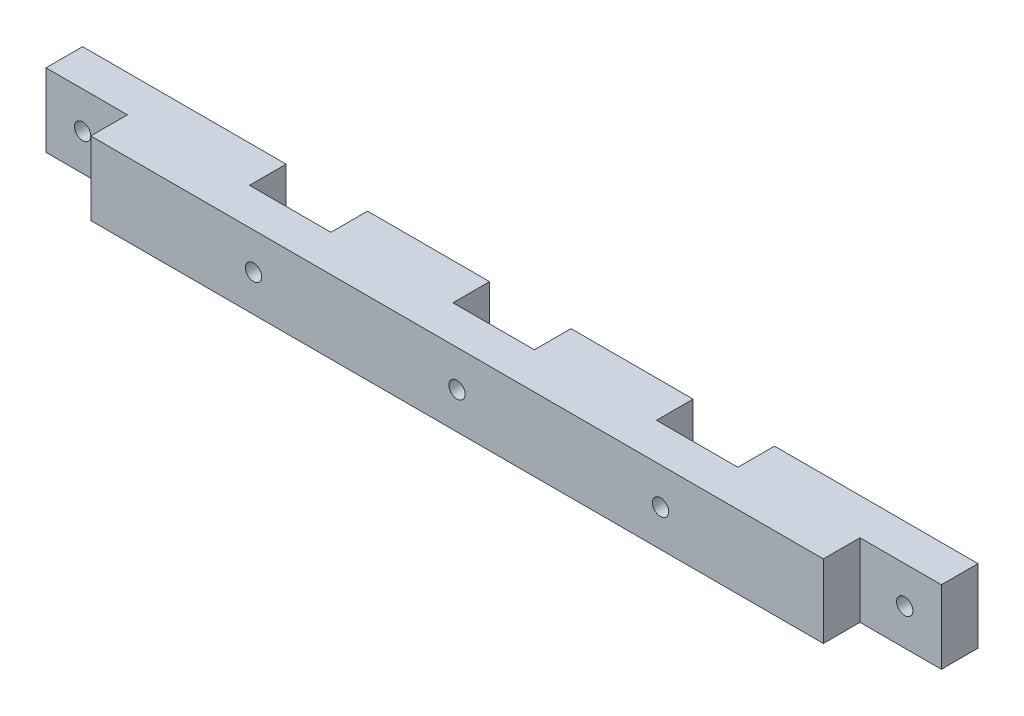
ISO-10303-21;
HEADER;
FILE_DESCRIPTION(('STEP AP214'),'2;1');
FILE_NAME('part.step','',(''),(''),'','','');
FILE_SCHEMA(('AUTOMOTIVE_DESIGN { 1 0 10303 214 1 1 1 1 }'));
ENDSEC;
DATA;
#1=APPLICATION_CONTEXT('core data for automotive mechanical design processes');
#2=APPLICATION_PROTOCOL_DEFINITION('international standard','automotive_design',2000,#1);
#3=PRODUCT_CONTEXT('',#1,'mechanical');
#4=PRODUCT('Part','Part','',(#3));
#5=PRODUCT_RELATED_PRODUCT_CATEGORY('part','',(#4));
#6=PRODUCT_DEFINITION_FORMATION('','',#4);
#7=PRODUCT_DEFINITION_CONTEXT('part definition',#1,'design');
#8=PRODUCT_DEFINITION('design','',#6,#7);
#9=PRODUCT_DEFINITION_SHAPE('','',#8);
#10=(LENGTH_UNIT() NAMED_UNIT(*) SI_UNIT(.MILLI.,.METRE.));
#11=(NAMED_UNIT(*) PLANE_ANGLE_UNIT() SI_UNIT($,.RADIAN.));
#12=(NAMED_UNIT(*) SI_UNIT($,.STERADIAN.) SOLID_ANGLE_UNIT());
#13=UNCERTAINTY_MEASURE_WITH_UNIT(LENGTH_MEASURE(1.E-05),#10,'distance_accuracy_value','');
#14=(GEOMETRIC_REPRESENTATION_CONTEXT(3) GLOBAL_UNCERTAINTY_ASSIGNED_CONTEXT((#13)) GLOBAL_UNIT_ASSIGNED_CONTEXT((#10,
#11,#12)) REPRESENTATION_CONTEXT('',''));
#15=CARTESIAN_POINT('',(0.,0.,0.));
#16=DIRECTION('',(0.,0.,1.));
#17=DIRECTION('',(1.,0.,0.));
#18=AXIS2_PLACEMENT_3D('',#15,#16,#17);
#19=CARTESIAN_POINT('',(-67.2716845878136,-100.617562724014,0.));
#20=DIRECTION('',(0.,0.,-1.));
#21=DIRECTION('',(-1.,0.,0.));
#22=AXIS2_PLACEMENT_3D('',#19,#20,#21);
#23=PLANE('',#22);
#24=DIRECTION('',(0.,-1.,0.));
#25=VECTOR('',#24,1.);
#26=CARTESIAN_POINT('',(-32.2716845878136,-100.617562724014,0.));
#27=LINE('',#26,#25);
#28=CARTESIAN_POINT('',(-32.2716845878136,-100.617562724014,0.));
#29=VERTEX_POINT('',#28);
#30=CARTESIAN_POINT('',(-32.2716845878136,-109.617562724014,0.));
#31=VERTEX_POINT('',#30);
#32=EDGE_CURVE('E172',#29,#31,#27,.T.);
#33=ORIENTED_EDGE('',*,*,#32,.F.);
#34=DIRECTION('',(-1.,0.,0.));
#35=VECTOR('',#34,1.);
#36=CARTESIAN_POINT('',(-67.2716845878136,-100.617562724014,0.));
#37=LINE('',#36,#35);
#38=CARTESIAN_POINT('',(-17.2716845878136,-100.617562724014,0.));
#39=VERTEX_POINT('',#38);
#40=EDGE_CURVE('E374',#39,#29,#37,.T.);
#41=ORIENTED_EDGE('',*,*,#40,.F.);
#42=DIRECTION('',(0.,1.,0.));
#43=VECTOR('',#42,1.);
#44=CARTESIAN_POINT('',(-17.2716845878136,-100.617562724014,0.));
#45=LINE('',#44,#43);
#46=CARTESIAN_POINT('',(-17.2716845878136,-109.617562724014,0.));
#47=VERTEX_POINT('',#46);
#48=EDGE_CURVE('E207',#47,#39,#45,.T.);
#49=ORIENTED_EDGE('',*,*,#48,.F.);
#50=DIRECTION('',(1.,0.,0.));
#51=VECTOR('',#50,1.);
#52=CARTESIAN_POINT('',(-67.2716845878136,-109.617562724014,0.));
#53=LINE('',#52,#51);
#54=EDGE_CURVE('E53',#31,#47,#53,.T.);
#55=ORIENTED_EDGE('',*,*,#54,.F.);
#56=EDGE_LOOP('',(#33,#41,#49,#55));
#57=FACE_BOUND('',#56,.T.);
#58=ADVANCED_FACE('F30',(#57),#23,.T.);
#59=DIRECTION('',(0.,-1.,0.));
#60=VECTOR('',#59,1.);
#61=CARTESIAN_POINT('',(-7.27168458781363,-100.617562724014,0.));
#62=LINE('',#61,#60);
#63=CARTESIAN_POINT('',(-7.27168458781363,-100.617562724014,0.));
#64=VERTEX_POINT('',#63);
#65=CARTESIAN_POINT('',(-7.27168458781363,-109.617562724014,0.));
#66=VERTEX_POINT('',#65);
#67=EDGE_CURVE('E198',#64,#66,#62,.T.);
#68=ORIENTED_EDGE('',*,*,#67,.F.);
#69=CARTESIAN_POINT('',(7.72831541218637,-100.617562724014,0.));
#70=VERTEX_POINT('',#69);
#71=EDGE_CURVE('E321',#70,#64,#37,.T.);
#72=ORIENTED_EDGE('',*,*,#71,.F.);
#73=DIRECTION('',(0.,1.,0.));
#74=VECTOR('',#73,1.);
#75=CARTESIAN_POINT('',(7.72831541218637,-109.617562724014,0.));
#76=LINE('',#75,#74);
#77=CARTESIAN_POINT('',(7.72831541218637,-109.617562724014,0.));
#78=VERTEX_POINT('',#77);
#79=EDGE_CURVE('E233',#78,#70,#76,.T.);
#80=ORIENTED_EDGE('',*,*,#79,.F.);
#81=EDGE_CURVE('E377',#66,#78,#53,.T.);
#82=ORIENTED_EDGE('',*,*,#81,.F.);
#83=EDGE_LOOP('',(#68,#72,#80,#82));
#84=FACE_BOUND('',#83,.T.);
#85=ADVANCED_FACE('F392',(#84),#23,.T.);
#86=DIRECTION('',(0.,-1.,0.));
#87=VECTOR('',#86,1.);
#88=CARTESIAN_POINT('',(17.7283154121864,-109.617562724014,0.));
#89=LINE('',#88,#87);
#90=CARTESIAN_POINT('',(17.7283154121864,-100.617562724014,0.));
#91=VERTEX_POINT('',#90);
#92=CARTESIAN_POINT('',(17.7283154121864,-109.617562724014,0.));
#93=VERTEX_POINT('',#92);
#94=EDGE_CURVE('E221',#91,#93,#89,.T.);
#95=ORIENTED_EDGE('',*,*,#94,.F.);
#96=CARTESIAN_POINT('',(42.7283154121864,-100.617562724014,0.));
#97=VERTEX_POINT('',#96);
#98=EDGE_CURVE('E307',#97,#91,#37,.T.);
#99=ORIENTED_EDGE('',*,*,#98,.F.);
#100=DIRECTION('',(0.,1.,0.));
#101=VECTOR('',#100,1.);
#102=CARTESIAN_POINT('',(42.7283154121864,-109.617562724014,0.));
#103=LINE('',#102,#101);
#104=CARTESIAN_POINT('',(42.7283154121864,-109.617562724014,0.));
#105=VERTEX_POINT('',#104);
#106=EDGE_CURVE('E315',#105,#97,#103,.T.);
#107=ORIENTED_EDGE('',*,*,#106,.F.);
#108=EDGE_CURVE('E312',#93,#105,#53,.T.);
#109=ORIENTED_EDGE('',*,*,#108,.F.);
#110=EDGE_LOOP('',(#95,#99,#107,#109));
#111=FACE_BOUND('',#110,.T.);
#112=CARTESIAN_POINT('',(38.2284017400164,-105.145436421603,0.));
#113=DIRECTION('',(0.,0.,1.));
#114=DIRECTION('',(1.,0.,0.));
#115=AXIS2_PLACEMENT_3D('',#112,#113,#114);
#116=CIRCLE('',#115,0.999999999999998);
#117=CARTESIAN_POINT('',(39.2284017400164,-105.145436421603,0.));
#118=VERTEX_POINT('',#117);
#119=EDGE_CURVE('E262',#118,#118,#116,.T.);
#120=ORIENTED_EDGE('',*,*,#119,.T.);
#121=EDGE_LOOP('',(#120));
#122=FACE_BOUND('',#121,.T.);
#123=ADVANCED_FACE('F337',(#111,#122),#23,.T.);
#124=CARTESIAN_POINT('',(42.7283154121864,-109.617562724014,9.));
#125=DIRECTION('',(-1.,0.,0.));
#126=DIRECTION('',(0.,0.,1.));
#127=AXIS2_PLACEMENT_3D('',#124,#125,#126);
#128=PLANE('',#127);
#129=DIRECTION('',(0.,1.,0.));
#130=VECTOR('',#129,1.);
#131=CARTESIAN_POINT('',(42.7283154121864,-109.617562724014,4.5));
#132=LINE('',#131,#130);
#133=CARTESIAN_POINT('',(42.7283154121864,-109.617562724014,4.5));
#134=VERTEX_POINT('',#133);
#135=CARTESIAN_POINT('',(42.7283154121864,-100.617562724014,4.5));
#136=VERTEX_POINT('',#135);
#137=EDGE_CURVE('E268',#134,#136,#132,.T.);
#138=ORIENTED_EDGE('',*,*,#137,.F.);
#139=DIRECTION('',(0.,0.,-1.));
#140=VECTOR('',#139,1.);
#141=CARTESIAN_POINT('',(42.7283154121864,-109.617562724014,9.));
#142=LINE('',#141,#140);
#143=EDGE_CURVE('E38',#134,#105,#142,.T.);
#144=ORIENTED_EDGE('',*,*,#143,.T.);
#145=ORIENTED_EDGE('',*,*,#106,.T.);
#146=DIRECTION('',(0.,0.,-1.));
#147=VECTOR('',#146,1.);
#148=CARTESIAN_POINT('',(42.7283154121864,-100.617562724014,9.));
#149=LINE('',#148,#147);
#150=EDGE_CURVE('E324',#136,#97,#149,.T.);
#151=ORIENTED_EDGE('',*,*,#150,.F.);
#152=EDGE_LOOP('',(#138,#144,#145,#151));
#153=FACE_BOUND('',#152,.T.);
#154=ADVANCED_FACE('F330',(#153),#128,.F.);
#155=CARTESIAN_POINT('',(-67.2716845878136,-109.617562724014,9.));
#156=DIRECTION('',(1.,0.,0.));
#157=DIRECTION('',(0.,0.,-1.));
#158=AXIS2_PLACEMENT_3D('',#155,#156,#157);
#159=PLANE('',#158);
#160=DIRECTION('',(0.,0.,-1.));
#161=VECTOR('',#160,1.);
#162=CARTESIAN_POINT('',(-67.2716845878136,-109.617562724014,9.));
#163=LINE('',#162,#161);
#164=CARTESIAN_POINT('',(-67.2716845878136,-109.617562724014,4.5));
#165=VERTEX_POINT('',#164);
#166=CARTESIAN_POINT('',(-67.2716845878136,-109.617562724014,0.));
#167=VERTEX_POINT('',#166);
#168=EDGE_CURVE('E11',#165,#167,#163,.T.);
#169=ORIENTED_EDGE('',*,*,#168,.F.);
#170=DIRECTION('',(0.,-1.,0.));
#171=VECTOR('',#170,1.);
#172=CARTESIAN_POINT('',(-67.2716845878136,-109.617562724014,4.5));
#173=LINE('',#172,#171);
#174=CARTESIAN_POINT('',(-67.2716845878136,-100.617562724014,4.5));
#175=VERTEX_POINT('',#174);
#176=EDGE_CURVE('E285',#175,#165,#173,.T.);
#177=ORIENTED_EDGE('',*,*,#176,.F.);
#178=DIRECTION('',(0.,0.,-1.));
#179=VECTOR('',#178,1.);
#180=CARTESIAN_POINT('',(-67.2716845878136,-100.617562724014,9.));
#181=LINE('',#180,#179);
#182=CARTESIAN_POINT('',(-67.2716845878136,-100.617562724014,0.));
#183=VERTEX_POINT('',#182);
#184=EDGE_CURVE('E309',#175,#183,#181,.T.);
#185=ORIENTED_EDGE('',*,*,#184,.T.);
#186=DIRECTION('',(0.,-1.,0.));
#187=VECTOR('',#186,1.);
#188=CARTESIAN_POINT('',(-67.2716845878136,-109.617562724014,0.));
#189=LINE('',#188,#187);
#190=EDGE_CURVE('E301',#183,#167,#189,.T.);
#191=ORIENTED_EDGE('',*,*,#190,.T.);
#192=EDGE_LOOP('',(#169,#177,#185,#191));
#193=FACE_BOUND('',#192,.T.);
#194=ADVANCED_FACE('F32',(#193),#159,.F.);
#195=CARTESIAN_POINT('',(-67.2716845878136,-109.617562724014,9.));
#196=DIRECTION('',(0.,1.,0.));
#197=DIRECTION('',(0.,0.,1.));
#198=AXIS2_PLACEMENT_3D('',#195,#196,#197);
#199=PLANE('',#198);
#200=DIRECTION('',(-1.,0.,0.));
#201=VECTOR('',#200,1.);
#202=CARTESIAN_POINT('',(-32.2716845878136,-109.617562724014,4.5));
#203=LINE('',#202,#201);
#204=CARTESIAN_POINT('',(-32.2716845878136,-109.617562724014,4.5));
#205=VERTEX_POINT('',#204);
#206=CARTESIAN_POINT('',(-42.2716845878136,-109.617562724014,4.5));
#207=VERTEX_POINT('',#206);
#208=EDGE_CURVE('E180',#205,#207,#203,.T.);
#209=ORIENTED_EDGE('',*,*,#208,.F.);
#210=DIRECTION('',(0.,0.,-1.));
#211=VECTOR('',#210,1.);
#212=CARTESIAN_POINT('',(-32.2716845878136,-109.617562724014,4.5));
#213=LINE('',#212,#211);
#214=EDGE_CURVE('E166',#205,#31,#213,.T.);
#215=ORIENTED_EDGE('',*,*,#214,.T.);
#216=ORIENTED_EDGE('',*,*,#54,.T.);
#217=DIRECTION('',(0.,0.,-1.));
#218=VECTOR('',#217,1.);
#219=CARTESIAN_POINT('',(-17.2716845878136,-109.617562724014,4.5));
#220=LINE('',#219,#218);
#221=CARTESIAN_POINT('',(-17.2716845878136,-109.617562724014,4.5));
#222=VERTEX_POINT('',#221);
#223=EDGE_CURVE('E225',#222,#47,#220,.T.);
#224=ORIENTED_EDGE('',*,*,#223,.F.);
#225=DIRECTION('',(-1.,0.,0.));
#226=VECTOR('',#225,1.);
#227=CARTESIAN_POINT('',(-7.27168458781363,-109.617562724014,4.5));
#228=LINE('',#227,#226);
#229=CARTESIAN_POINT('',(-7.27168458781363,-109.617562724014,4.5));
#230=VERTEX_POINT('',#229);
#231=EDGE_CURVE('E206',#230,#222,#228,.T.);
#232=ORIENTED_EDGE('',*,*,#231,.F.);
#233=DIRECTION('',(0.,0.,-1.));
#234=VECTOR('',#233,1.);
#235=CARTESIAN_POINT('',(-7.27168458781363,-109.617562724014,4.5));
#236=LINE('',#235,#234);
#237=EDGE_CURVE('E216',#230,#66,#236,.T.);
#238=ORIENTED_EDGE('',*,*,#237,.T.);
#239=ORIENTED_EDGE('',*,*,#81,.T.);
#240=DIRECTION('',(0.,0.,-1.));
#241=VECTOR('',#240,1.);
#242=CARTESIAN_POINT('',(7.72831541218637,-109.617562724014,4.5));
#243=LINE('',#242,#241);
#244=CARTESIAN_POINT('',(7.72831541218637,-109.617562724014,4.5));
#245=VERTEX_POINT('',#244);
#246=EDGE_CURVE('E251',#245,#78,#243,.T.);
#247=ORIENTED_EDGE('',*,*,#246,.F.);
#248=DIRECTION('',(-1.,0.,0.));
#249=VECTOR('',#248,1.);
#250=CARTESIAN_POINT('',(17.7283154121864,-109.617562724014,4.5));
#251=LINE('',#250,#249);
#252=CARTESIAN_POINT('',(17.7283154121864,-109.617562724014,4.5));
#253=VERTEX_POINT('',#252);
#254=EDGE_CURVE('E232',#253,#245,#251,.T.);
#255=ORIENTED_EDGE('',*,*,#254,.F.);
#256=DIRECTION('',(0.,0.,-1.));
#257=VECTOR('',#256,1.);
#258=CARTESIAN_POINT('',(17.7283154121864,-109.617562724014,4.5));
#259=LINE('',#258,#257);
#260=EDGE_CURVE('E242',#253,#93,#259,.T.);
#261=ORIENTED_EDGE('',*,*,#260,.T.);
#262=ORIENTED_EDGE('',*,*,#108,.T.);
#263=ORIENTED_EDGE('',*,*,#143,.F.);
#264=DIRECTION('',(1.,0.,0.));
#265=VECTOR('',#264,1.);
#266=CARTESIAN_POINT('',(42.7283154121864,-109.617562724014,4.5));
#267=LINE('',#266,#265);
#268=CARTESIAN_POINT('',(32.7283154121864,-109.617562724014,4.5));
#269=VERTEX_POINT('',#268);
#270=EDGE_CURVE('E276',#269,#134,#267,.T.);
#271=ORIENTED_EDGE('',*,*,#270,.F.);
#272=DIRECTION('',(0.,0.,1.));
#273=VECTOR('',#272,1.);
#274=CARTESIAN_POINT('',(32.7283154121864,-109.617562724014,4.5));
#275=LINE('',#274,#273);
#276=CARTESIAN_POINT('',(32.7283154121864,-109.617562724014,9.));
#277=VERTEX_POINT('',#276);
#278=EDGE_CURVE('E280',#269,#277,#275,.T.);
#279=ORIENTED_EDGE('',*,*,#278,.T.);
#280=DIRECTION('',(1.,0.,0.));
#281=VECTOR('',#280,1.);
#282=CARTESIAN_POINT('',(-67.2716845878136,-109.617562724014,9.));
#283=LINE('',#282,#281);
#284=CARTESIAN_POINT('',(-57.2716845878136,-109.617562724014,9.));
#285=VERTEX_POINT('',#284);
#286=EDGE_CURVE('E303',#285,#277,#283,.T.);
#287=ORIENTED_EDGE('',*,*,#286,.F.);
#288=DIRECTION('',(0.,0.,1.));
#289=VECTOR('',#288,1.);
#290=CARTESIAN_POINT('',(-57.2716845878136,-109.617562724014,4.5));
#291=LINE('',#290,#289);
#292=CARTESIAN_POINT('',(-57.2716845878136,-109.617562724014,4.5));
#293=VERTEX_POINT('',#292);
#294=EDGE_CURVE('E295',#293,#285,#291,.T.);
#295=ORIENTED_EDGE('',*,*,#294,.F.);
#296=DIRECTION('',(1.,0.,0.));
#297=VECTOR('',#296,1.);
#298=CARTESIAN_POINT('',(-67.2716845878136,-109.617562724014,4.5));
#299=LINE('',#298,#297);
#300=EDGE_CURVE('E287',#165,#293,#299,.T.);
#301=ORIENTED_EDGE('',*,*,#300,.F.);
#302=ORIENTED_EDGE('',*,*,#168,.T.);
#303=CARTESIAN_POINT('',(-42.2716845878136,-109.617562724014,0.));
#304=VERTEX_POINT('',#303);
#305=EDGE_CURVE('E313',#167,#304,#53,.T.);
#306=ORIENTED_EDGE('',*,*,#305,.T.);
#307=DIRECTION('',(0.,0.,-1.));
#308=VECTOR('',#307,1.);
#309=CARTESIAN_POINT('',(-42.2716845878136,-109.617562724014,4.5));
#310=LINE('',#309,#308);
#311=EDGE_CURVE('E45',#207,#304,#310,.T.);
#312=ORIENTED_EDGE('',*,*,#311,.F.);
#313=EDGE_LOOP('',(#209,#215,#216,#224,#232,#238,#239,#247,#255,#261,#262,#263,#271,#279,#287,
#295,#301,#302,#306,#312));
#314=FACE_BOUND('',#313,.T.);
#315=ADVANCED_FACE('F185',(#314),#199,.F.);
#316=CARTESIAN_POINT('',(-67.2716845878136,-100.617562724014,9.));
#317=DIRECTION('',(0.,-1.,0.));
#318=DIRECTION('',(0.,0.,-1.));
#319=AXIS2_PLACEMENT_3D('',#316,#317,#318);
#320=PLANE('',#319);
#321=ORIENTED_EDGE('',*,*,#40,.T.);
#322=DIRECTION('',(0.,0.,-1.));
#323=VECTOR('',#322,1.);
#324=CARTESIAN_POINT('',(-32.2716845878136,-100.617562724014,4.5));
#325=LINE('',#324,#323);
#326=CARTESIAN_POINT('',(-32.2716845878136,-100.617562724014,4.5));
#327=VERTEX_POINT('',#326);
#328=EDGE_CURVE('E196',#327,#29,#325,.T.);
#329=ORIENTED_EDGE('',*,*,#328,.F.);
#330=DIRECTION('',(1.,0.,0.));
#331=VECTOR('',#330,1.);
#332=CARTESIAN_POINT('',(-32.2716845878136,-100.617562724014,4.5));
#333=LINE('',#332,#331);
#334=CARTESIAN_POINT('',(-42.2716845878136,-100.617562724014,4.5));
#335=VERTEX_POINT('',#334);
#336=EDGE_CURVE('E174',#335,#327,#333,.T.);
#337=ORIENTED_EDGE('',*,*,#336,.F.);
#338=DIRECTION('',(0.,0.,-1.));
#339=VECTOR('',#338,1.);
#340=CARTESIAN_POINT('',(-42.2716845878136,-100.617562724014,4.5));
#341=LINE('',#340,#339);
#342=CARTESIAN_POINT('',(-42.2716845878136,-100.617562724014,0.));
#343=VERTEX_POINT('',#342);
#344=EDGE_CURVE('E199',#335,#343,#341,.T.);
#345=ORIENTED_EDGE('',*,*,#344,.T.);
#346=EDGE_CURVE('E318',#343,#183,#37,.T.);
#347=ORIENTED_EDGE('',*,*,#346,.T.);
#348=ORIENTED_EDGE('',*,*,#184,.F.);
#349=DIRECTION('',(-1.,0.,0.));
#350=VECTOR('',#349,1.);
#351=CARTESIAN_POINT('',(-67.2716845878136,-100.617562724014,4.5));
#352=LINE('',#351,#350);
#353=CARTESIAN_POINT('',(-57.2716845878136,-100.617562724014,4.5));
#354=VERTEX_POINT('',#353);
#355=EDGE_CURVE('E293',#354,#175,#352,.T.);
#356=ORIENTED_EDGE('',*,*,#355,.F.);
#357=DIRECTION('',(0.,0.,1.));
#358=VECTOR('',#357,1.);
#359=CARTESIAN_POINT('',(-57.2716845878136,-100.617562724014,4.5));
#360=LINE('',#359,#358);
#361=CARTESIAN_POINT('',(-57.2716845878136,-100.617562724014,9.));
#362=VERTEX_POINT('',#361);
#363=EDGE_CURVE('E298',#354,#362,#360,.T.);
#364=ORIENTED_EDGE('',*,*,#363,.T.);
#365=DIRECTION('',(-1.,0.,0.));
#366=VECTOR('',#365,1.);
#367=CARTESIAN_POINT('',(-67.2716845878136,-100.617562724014,9.));
#368=LINE('',#367,#366);
#369=CARTESIAN_POINT('',(32.7283154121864,-100.617562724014,9.));
#370=VERTEX_POINT('',#369);
#371=EDGE_CURVE('E306',#370,#362,#368,.T.);
#372=ORIENTED_EDGE('',*,*,#371,.F.);
#373=DIRECTION('',(0.,0.,1.));
#374=VECTOR('',#373,1.);
#375=CARTESIAN_POINT('',(32.7283154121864,-100.617562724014,4.5));
#376=LINE('',#375,#374);
#377=CARTESIAN_POINT('',(32.7283154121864,-100.617562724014,4.5));
#378=VERTEX_POINT('',#377);
#379=EDGE_CURVE('E278',#378,#370,#376,.T.);
#380=ORIENTED_EDGE('',*,*,#379,.F.);
#381=DIRECTION('',(-1.,0.,0.));
#382=VECTOR('',#381,1.);
#383=CARTESIAN_POINT('',(42.7283154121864,-100.617562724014,4.5));
#384=LINE('',#383,#382);
#385=EDGE_CURVE('E270',#136,#378,#384,.T.);
#386=ORIENTED_EDGE('',*,*,#385,.F.);
#387=ORIENTED_EDGE('',*,*,#150,.T.);
#388=ORIENTED_EDGE('',*,*,#98,.T.);
#389=DIRECTION('',(0.,0.,-1.));
#390=VECTOR('',#389,1.);
#391=CARTESIAN_POINT('',(17.7283154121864,-100.617562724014,4.5));
#392=LINE('',#391,#390);
#393=CARTESIAN_POINT('',(17.7283154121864,-100.617562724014,4.5));
#394=VERTEX_POINT('',#393);
#395=EDGE_CURVE('E245',#394,#91,#392,.T.);
#396=ORIENTED_EDGE('',*,*,#395,.F.);
#397=DIRECTION('',(1.,0.,0.));
#398=VECTOR('',#397,1.);
#399=CARTESIAN_POINT('',(17.7283154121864,-100.617562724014,4.5));
#400=LINE('',#399,#398);
#401=CARTESIAN_POINT('',(7.72831541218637,-100.617562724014,4.5));
#402=VERTEX_POINT('',#401);
#403=EDGE_CURVE('E239',#402,#394,#400,.T.);
#404=ORIENTED_EDGE('',*,*,#403,.F.);
#405=DIRECTION('',(0.,0.,-1.));
#406=VECTOR('',#405,1.);
#407=CARTESIAN_POINT('',(7.72831541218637,-100.617562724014,4.5));
#408=LINE('',#407,#406);
#409=EDGE_CURVE('E248',#402,#70,#408,.T.);
#410=ORIENTED_EDGE('',*,*,#409,.T.);
#411=ORIENTED_EDGE('',*,*,#71,.T.);
#412=DIRECTION('',(0.,0.,-1.));
#413=VECTOR('',#412,1.);
#414=CARTESIAN_POINT('',(-7.27168458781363,-100.617562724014,4.5));
#415=LINE('',#414,#413);
#416=CARTESIAN_POINT('',(-7.27168458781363,-100.617562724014,4.5));
#417=VERTEX_POINT('',#416);
#418=EDGE_CURVE('E219',#417,#64,#415,.T.);
#419=ORIENTED_EDGE('',*,*,#418,.F.);
#420=DIRECTION('',(1.,0.,0.));
#421=VECTOR('',#420,1.);
#422=CARTESIAN_POINT('',(-7.27168458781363,-100.617562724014,4.5));
#423=LINE('',#422,#421);
#424=CARTESIAN_POINT('',(-17.2716845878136,-100.617562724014,4.5));
#425=VERTEX_POINT('',#424);
#426=EDGE_CURVE('E213',#425,#417,#423,.T.);
#427=ORIENTED_EDGE('',*,*,#426,.F.);
#428=DIRECTION('',(0.,0.,-1.));
#429=VECTOR('',#428,1.);
#430=CARTESIAN_POINT('',(-17.2716845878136,-100.617562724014,4.5));
#431=LINE('',#430,#429);
#432=EDGE_CURVE('E222',#425,#39,#431,.T.);
#433=ORIENTED_EDGE('',*,*,#432,.T.);
#434=EDGE_LOOP('',(#321,#329,#337,#345,#347,#348,#356,#364,#372,#380,#386,#387,#388,#396,#404,
#410,#411,#419,#427,#433));
#435=FACE_BOUND('',#434,.T.);
#436=ADVANCED_FACE('F342',(#435),#320,.F.);
#437=CARTESIAN_POINT('',(-67.2716845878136,-100.617562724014,9.));
#438=DIRECTION('',(0.,0.,-1.));
#439=DIRECTION('',(-1.,0.,0.));
#440=AXIS2_PLACEMENT_3D('',#437,#438,#439);
#441=PLANE('',#440);
#442=CARTESIAN_POINT('',(-37.2716845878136,-105.117562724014,9.));
#443=DIRECTION('',(0.,0.,-1.));
#444=DIRECTION('',(-1.,0.,0.));
#445=AXIS2_PLACEMENT_3D('',#442,#443,#444);
#446=CIRCLE('',#445,0.999999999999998);
#447=CARTESIAN_POINT('',(-38.2716845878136,-105.117562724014,9.));
#448=VERTEX_POINT('',#447);
#449=EDGE_CURVE('E639',#448,#448,#446,.T.);
#450=ORIENTED_EDGE('',*,*,#449,.T.);
#451=EDGE_LOOP('',(#450));
#452=FACE_BOUND('',#451,.T.);
#453=CARTESIAN_POINT('',(-12.2716845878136,-105.117562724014,9.));
#454=DIRECTION('',(0.,0.,-1.));
#455=DIRECTION('',(-1.,0.,0.));
#456=AXIS2_PLACEMENT_3D('',#453,#454,#455);
#457=CIRCLE('',#456,1.);
#458=CARTESIAN_POINT('',(-13.2716845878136,-105.117562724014,9.));
#459=VERTEX_POINT('',#458);
#460=EDGE_CURVE('E647',#459,#459,#457,.T.);
#461=ORIENTED_EDGE('',*,*,#460,.T.);
#462=EDGE_LOOP('',(#461));
#463=FACE_BOUND('',#462,.T.);
#464=CARTESIAN_POINT('',(12.7283154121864,-105.117562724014,9.));
#465=DIRECTION('',(0.,0.,-1.));
#466=DIRECTION('',(-1.,0.,0.));
#467=AXIS2_PLACEMENT_3D('',#464,#465,#466);
#468=CIRCLE('',#467,1.);
#469=CARTESIAN_POINT('',(11.7283154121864,-105.117562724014,9.));
#470=VERTEX_POINT('',#469);
#471=EDGE_CURVE('E194',#470,#470,#468,.T.);
#472=ORIENTED_EDGE('',*,*,#471,.T.);
#473=EDGE_LOOP('',(#472));
#474=FACE_BOUND('',#473,.T.);
#475=ORIENTED_EDGE('',*,*,#286,.T.);
#476=DIRECTION('',(0.,-1.,0.));
#477=VECTOR('',#476,1.);
#478=CARTESIAN_POINT('',(32.7283154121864,-109.617562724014,9.));
#479=LINE('',#478,#477);
#480=EDGE_CURVE('E265',#370,#277,#479,.T.);
#481=ORIENTED_EDGE('',*,*,#480,.F.);
#482=ORIENTED_EDGE('',*,*,#371,.T.);
#483=DIRECTION('',(0.,1.,0.));
#484=VECTOR('',#483,1.);
#485=CARTESIAN_POINT('',(-57.2716845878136,-109.617562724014,9.));
#486=LINE('',#485,#484);
#487=EDGE_CURVE('E283',#285,#362,#486,.T.);
#488=ORIENTED_EDGE('',*,*,#487,.F.);
#489=EDGE_LOOP('',(#475,#481,#482,#488));
#490=FACE_BOUND('',#489,.T.);
#491=ADVANCED_FACE('F355',(#452,#463,#474,#490),#441,.F.);
#492=DIRECTION('',(0.,1.,0.));
#493=VECTOR('',#492,1.);
#494=CARTESIAN_POINT('',(-42.2716845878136,-100.617562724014,0.));
#495=LINE('',#494,#493);
#496=EDGE_CURVE('E183',#304,#343,#495,.T.);
#497=ORIENTED_EDGE('',*,*,#496,.F.);
#498=ORIENTED_EDGE('',*,*,#305,.F.);
#499=ORIENTED_EDGE('',*,*,#190,.F.);
#500=ORIENTED_EDGE('',*,*,#346,.F.);
#501=EDGE_LOOP('',(#497,#498,#499,#500));
#502=FACE_BOUND('',#501,.T.);
#503=CARTESIAN_POINT('',(-62.7716845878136,-105.117562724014,0.));
#504=DIRECTION('',(0.,0.,1.));
#505=DIRECTION('',(1.,0.,0.));
#506=AXIS2_PLACEMENT_3D('',#503,#504,#505);
#507=CIRCLE('',#506,0.999999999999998);
#508=CARTESIAN_POINT('',(-61.7716845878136,-105.117562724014,0.));
#509=VERTEX_POINT('',#508);
#510=EDGE_CURVE('E256',#509,#509,#507,.T.);
#511=ORIENTED_EDGE('',*,*,#510,.T.);
#512=EDGE_LOOP('',(#511));
#513=FACE_BOUND('',#512,.T.);
#514=ADVANCED_FACE('F369',(#502,#513),#23,.T.);
#515=CARTESIAN_POINT('',(-57.2716845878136,-109.617562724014,4.5));
#516=DIRECTION('',(1.,0.,0.));
#517=DIRECTION('',(0.,1.,0.));
#518=AXIS2_PLACEMENT_3D('',#515,#516,#517);
#519=PLANE('',#518);
#520=ORIENTED_EDGE('',*,*,#487,.T.);
#521=ORIENTED_EDGE('',*,*,#363,.F.);
#522=DIRECTION('',(0.,1.,0.));
#523=VECTOR('',#522,1.);
#524=CARTESIAN_POINT('',(-57.2716845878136,-109.617562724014,4.5));
#525=LINE('',#524,#523);
#526=EDGE_CURVE('E290',#293,#354,#525,.T.);
#527=ORIENTED_EDGE('',*,*,#526,.F.);
#528=ORIENTED_EDGE('',*,*,#294,.T.);
#529=EDGE_LOOP('',(#520,#521,#527,#528));
#530=FACE_BOUND('',#529,.T.);
#531=ADVANCED_FACE('F357',(#530),#519,.F.);
#532=CARTESIAN_POINT('',(-67.2716845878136,-100.617562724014,4.5));
#533=DIRECTION('',(0.,0.,-1.));
#534=DIRECTION('',(-1.,0.,0.));
#535=AXIS2_PLACEMENT_3D('',#532,#533,#534);
#536=PLANE('',#535);
#537=CARTESIAN_POINT('',(-62.7716845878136,-105.117562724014,4.5));
#538=DIRECTION('',(0.,0.,1.));
#539=DIRECTION('',(1.,0.,0.));
#540=AXIS2_PLACEMENT_3D('',#537,#538,#539);
#541=CIRCLE('',#540,0.999999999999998);
#542=CARTESIAN_POINT('',(-61.7716845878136,-105.117562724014,4.5));
#543=VERTEX_POINT('',#542);
#544=EDGE_CURVE('E247',#543,#543,#541,.T.);
#545=ORIENTED_EDGE('',*,*,#544,.F.);
#546=EDGE_LOOP('',(#545));
#547=FACE_BOUND('',#546,.T.);
#548=ORIENTED_EDGE('',*,*,#176,.T.);
#549=ORIENTED_EDGE('',*,*,#300,.T.);
#550=ORIENTED_EDGE('',*,*,#526,.T.);
#551=ORIENTED_EDGE('',*,*,#355,.T.);
#552=EDGE_LOOP('',(#548,#549,#550,#551));
#553=FACE_BOUND('',#552,.T.);
#554=ADVANCED_FACE('F362',(#547,#553),#536,.F.);
#555=CARTESIAN_POINT('',(32.7283154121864,-109.617562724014,4.5));
#556=DIRECTION('',(-1.,0.,0.));
#557=DIRECTION('',(0.,0.,1.));
#558=AXIS2_PLACEMENT_3D('',#555,#556,#557);
#559=PLANE('',#558);
#560=ORIENTED_EDGE('',*,*,#480,.T.);
#561=ORIENTED_EDGE('',*,*,#278,.F.);
#562=DIRECTION('',(0.,-1.,0.));
#563=VECTOR('',#562,1.);
#564=CARTESIAN_POINT('',(32.7283154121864,-109.617562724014,4.5));
#565=LINE('',#564,#563);
#566=EDGE_CURVE('E273',#378,#269,#565,.T.);
#567=ORIENTED_EDGE('',*,*,#566,.F.);
#568=ORIENTED_EDGE('',*,*,#379,.T.);
#569=EDGE_LOOP('',(#560,#561,#567,#568));
#570=FACE_BOUND('',#569,.T.);
#571=ADVANCED_FACE('F567',(#570),#559,.F.);
#572=CARTESIAN_POINT('',(42.7283154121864,-100.617562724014,4.5));
#573=DIRECTION('',(0.,0.,1.));
#574=DIRECTION('',(1.,0.,0.));
#575=AXIS2_PLACEMENT_3D('',#572,#573,#574);
#576=PLANE('',#575);
#577=CARTESIAN_POINT('',(38.2284017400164,-105.145436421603,4.5));
#578=DIRECTION('',(0.,0.,1.));
#579=DIRECTION('',(1.,0.,0.));
#580=AXIS2_PLACEMENT_3D('',#577,#578,#579);
#581=CIRCLE('',#580,0.999999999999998);
#582=CARTESIAN_POINT('',(39.2284017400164,-105.145436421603,4.5));
#583=VERTEX_POINT('',#582);
#584=EDGE_CURVE('E259',#583,#583,#581,.T.);
#585=ORIENTED_EDGE('',*,*,#584,.F.);
#586=EDGE_LOOP('',(#585));
#587=FACE_BOUND('',#586,.T.);
#588=ORIENTED_EDGE('',*,*,#137,.T.);
#589=ORIENTED_EDGE('',*,*,#385,.T.);
#590=ORIENTED_EDGE('',*,*,#566,.T.);
#591=ORIENTED_EDGE('',*,*,#270,.T.);
#592=EDGE_LOOP('',(#588,#589,#590,#591));
#593=FACE_BOUND('',#592,.T.);
#594=ADVANCED_FACE('F348',(#587,#593),#576,.T.);
#595=CARTESIAN_POINT('',(38.2284017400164,-105.145436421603,0.));
#596=DIRECTION('',(0.,0.,1.));
#597=DIRECTION('',(1.,0.,0.));
#598=AXIS2_PLACEMENT_3D('',#595,#596,#597);
#599=CYLINDRICAL_SURFACE('',#598,0.999999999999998);
#600=ORIENTED_EDGE('',*,*,#119,.F.);
#601=EDGE_LOOP('',(#600));
#602=FACE_BOUND('',#601,.T.);
#603=ORIENTED_EDGE('',*,*,#584,.T.);
#604=EDGE_LOOP('',(#603));
#605=FACE_BOUND('',#604,.T.);
#606=ADVANCED_FACE('F584',(#602,#605),#599,.F.);
#607=CARTESIAN_POINT('',(-62.7716845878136,-105.117562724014,0.));
#608=DIRECTION('',(0.,0.,1.));
#609=DIRECTION('',(1.,0.,0.));
#610=AXIS2_PLACEMENT_3D('',#607,#608,#609);
#611=CYLINDRICAL_SURFACE('',#610,0.999999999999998);
#612=ORIENTED_EDGE('',*,*,#510,.F.);
#613=EDGE_LOOP('',(#612));
#614=FACE_BOUND('',#613,.T.);
#615=ORIENTED_EDGE('',*,*,#544,.T.);
#616=EDGE_LOOP('',(#615));
#617=FACE_BOUND('',#616,.T.);
#618=ADVANCED_FACE('F540',(#614,#617),#611,.F.);
#619=CARTESIAN_POINT('',(17.7283154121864,-109.617562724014,4.5));
#620=DIRECTION('',(1.,0.,0.));
#621=DIRECTION('',(0.,1.,0.));
#622=AXIS2_PLACEMENT_3D('',#619,#620,#621);
#623=PLANE('',#622);
#624=ORIENTED_EDGE('',*,*,#94,.T.);
#625=ORIENTED_EDGE('',*,*,#260,.F.);
#626=DIRECTION('',(0.,-1.,0.));
#627=VECTOR('',#626,1.);
#628=CARTESIAN_POINT('',(17.7283154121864,-109.617562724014,4.5));
#629=LINE('',#628,#627);
#630=EDGE_CURVE('E229',#394,#253,#629,.T.);
#631=ORIENTED_EDGE('',*,*,#630,.F.);
#632=ORIENTED_EDGE('',*,*,#395,.T.);
#633=EDGE_LOOP('',(#624,#625,#631,#632));
#634=FACE_BOUND('',#633,.T.);
#635=ADVANCED_FACE('F382',(#634),#623,.F.);
#636=CARTESIAN_POINT('',(7.72831541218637,-109.617562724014,4.5));
#637=DIRECTION('',(-1.,0.,0.));
#638=DIRECTION('',(0.,-1.,0.));
#639=AXIS2_PLACEMENT_3D('',#636,#637,#638);
#640=PLANE('',#639);
#641=ORIENTED_EDGE('',*,*,#79,.T.);
#642=ORIENTED_EDGE('',*,*,#409,.F.);
#643=DIRECTION('',(0.,1.,0.));
#644=VECTOR('',#643,1.);
#645=CARTESIAN_POINT('',(7.72831541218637,-109.617562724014,4.5));
#646=LINE('',#645,#644);
#647=EDGE_CURVE('E236',#245,#402,#646,.T.);
#648=ORIENTED_EDGE('',*,*,#647,.F.);
#649=ORIENTED_EDGE('',*,*,#246,.T.);
#650=EDGE_LOOP('',(#641,#642,#648,#649));
#651=FACE_BOUND('',#650,.T.);
#652=ADVANCED_FACE('F457',(#651),#640,.F.);
#653=CARTESIAN_POINT('',(17.7283154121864,-100.617562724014,4.5));
#654=DIRECTION('',(0.,0.,1.));
#655=DIRECTION('',(1.,0.,0.));
#656=AXIS2_PLACEMENT_3D('',#653,#654,#655);
#657=PLANE('',#656);
#658=CARTESIAN_POINT('',(12.7283154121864,-105.117562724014,4.5));
#659=DIRECTION('',(0.,0.,-1.));
#660=DIRECTION('',(-1.,0.,0.));
#661=AXIS2_PLACEMENT_3D('',#658,#659,#660);
#662=CIRCLE('',#661,1.);
#663=CARTESIAN_POINT('',(11.7283154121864,-105.117562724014,4.5));
#664=VERTEX_POINT('',#663);
#665=EDGE_CURVE('E650',#664,#664,#662,.T.);
#666=ORIENTED_EDGE('',*,*,#665,.F.);
#667=EDGE_LOOP('',(#666));
#668=FACE_BOUND('',#667,.T.);
#669=ORIENTED_EDGE('',*,*,#630,.T.);
#670=ORIENTED_EDGE('',*,*,#254,.T.);
#671=ORIENTED_EDGE('',*,*,#647,.T.);
#672=ORIENTED_EDGE('',*,*,#403,.T.);
#673=EDGE_LOOP('',(#669,#670,#671,#672));
#674=FACE_BOUND('',#673,.T.);
#675=ADVANCED_FACE('F384',(#668,#674),#657,.F.);
#676=CARTESIAN_POINT('',(-7.27168458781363,-100.617562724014,4.5));
#677=DIRECTION('',(1.,0.,0.));
#678=DIRECTION('',(0.,1.,0.));
#679=AXIS2_PLACEMENT_3D('',#676,#677,#678);
#680=PLANE('',#679);
#681=ORIENTED_EDGE('',*,*,#67,.T.);
#682=ORIENTED_EDGE('',*,*,#237,.F.);
#683=DIRECTION('',(0.,-1.,0.));
#684=VECTOR('',#683,1.);
#685=CARTESIAN_POINT('',(-7.27168458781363,-100.617562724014,4.5));
#686=LINE('',#685,#684);
#687=EDGE_CURVE('E203',#417,#230,#686,.T.);
#688=ORIENTED_EDGE('',*,*,#687,.F.);
#689=ORIENTED_EDGE('',*,*,#418,.T.);
#690=EDGE_LOOP('',(#681,#682,#688,#689));
#691=FACE_BOUND('',#690,.T.);
#692=ADVANCED_FACE('F394',(#691),#680,.F.);
#693=CARTESIAN_POINT('',(-17.2716845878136,-100.617562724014,4.5));
#694=DIRECTION('',(-1.,0.,0.));
#695=DIRECTION('',(0.,0.,1.));
#696=AXIS2_PLACEMENT_3D('',#693,#694,#695);
#697=PLANE('',#696);
#698=ORIENTED_EDGE('',*,*,#48,.T.);
#699=ORIENTED_EDGE('',*,*,#432,.F.);
#700=DIRECTION('',(0.,1.,0.));
#701=VECTOR('',#700,1.);
#702=CARTESIAN_POINT('',(-17.2716845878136,-100.617562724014,4.5));
#703=LINE('',#702,#701);
#704=EDGE_CURVE('E210',#222,#425,#703,.T.);
#705=ORIENTED_EDGE('',*,*,#704,.F.);
#706=ORIENTED_EDGE('',*,*,#223,.T.);
#707=EDGE_LOOP('',(#698,#699,#705,#706));
#708=FACE_BOUND('',#707,.T.);
#709=ADVANCED_FACE('F400',(#708),#697,.F.);
#710=CARTESIAN_POINT('',(-7.27168458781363,-109.617562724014,4.5));
#711=DIRECTION('',(0.,0.,-1.));
#712=DIRECTION('',(-1.,0.,0.));
#713=AXIS2_PLACEMENT_3D('',#710,#711,#712);
#714=PLANE('',#713);
#715=CARTESIAN_POINT('',(-12.2716845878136,-105.117562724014,4.5));
#716=DIRECTION('',(0.,0.,-1.));
#717=DIRECTION('',(-1.,0.,0.));
#718=AXIS2_PLACEMENT_3D('',#715,#716,#717);
#719=CIRCLE('',#718,1.);
#720=CARTESIAN_POINT('',(-13.2716845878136,-105.117562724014,4.5));
#721=VERTEX_POINT('',#720);
#722=EDGE_CURVE('E644',#721,#721,#719,.T.);
#723=ORIENTED_EDGE('',*,*,#722,.F.);
#724=EDGE_LOOP('',(#723));
#725=FACE_BOUND('',#724,.T.);
#726=ORIENTED_EDGE('',*,*,#687,.T.);
#727=ORIENTED_EDGE('',*,*,#231,.T.);
#728=ORIENTED_EDGE('',*,*,#704,.T.);
#729=ORIENTED_EDGE('',*,*,#426,.T.);
#730=EDGE_LOOP('',(#726,#727,#728,#729));
#731=FACE_BOUND('',#730,.T.);
#732=ADVANCED_FACE('F397',(#725,#731),#714,.T.);
#733=CARTESIAN_POINT('',(-32.2716845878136,-100.617562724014,4.5));
#734=DIRECTION('',(1.,0.,0.));
#735=DIRECTION('',(0.,0.,-1.));
#736=AXIS2_PLACEMENT_3D('',#733,#734,#735);
#737=PLANE('',#736);
#738=ORIENTED_EDGE('',*,*,#32,.T.);
#739=ORIENTED_EDGE('',*,*,#214,.F.);
#740=DIRECTION('',(0.,-1.,0.));
#741=VECTOR('',#740,1.);
#742=CARTESIAN_POINT('',(-32.2716845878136,-100.617562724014,4.5));
#743=LINE('',#742,#741);
#744=EDGE_CURVE('E169',#327,#205,#743,.T.);
#745=ORIENTED_EDGE('',*,*,#744,.F.);
#746=ORIENTED_EDGE('',*,*,#328,.T.);
#747=EDGE_LOOP('',(#738,#739,#745,#746));
#748=FACE_BOUND('',#747,.T.);
#749=ADVANCED_FACE('F168',(#748),#737,.F.);
#750=CARTESIAN_POINT('',(-42.2716845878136,-100.617562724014,4.5));
#751=DIRECTION('',(-1.,0.,0.));
#752=DIRECTION('',(0.,0.,1.));
#753=AXIS2_PLACEMENT_3D('',#750,#751,#752);
#754=PLANE('',#753);
#755=ORIENTED_EDGE('',*,*,#496,.T.);
#756=ORIENTED_EDGE('',*,*,#344,.F.);
#757=DIRECTION('',(0.,1.,0.));
#758=VECTOR('',#757,1.);
#759=CARTESIAN_POINT('',(-42.2716845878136,-100.617562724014,4.5));
#760=LINE('',#759,#758);
#761=EDGE_CURVE('E187',#207,#335,#760,.T.);
#762=ORIENTED_EDGE('',*,*,#761,.F.);
#763=ORIENTED_EDGE('',*,*,#311,.T.);
#764=EDGE_LOOP('',(#755,#756,#762,#763));
#765=FACE_BOUND('',#764,.T.);
#766=ADVANCED_FACE('F372',(#765),#754,.F.);
#767=CARTESIAN_POINT('',(-32.2716845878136,-109.617562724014,4.5));
#768=DIRECTION('',(0.,0.,-1.));
#769=DIRECTION('',(-1.,0.,0.));
#770=AXIS2_PLACEMENT_3D('',#767,#768,#769);
#771=PLANE('',#770);
#772=CARTESIAN_POINT('',(-37.2716845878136,-105.117562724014,4.5));
#773=DIRECTION('',(0.,0.,-1.));
#774=DIRECTION('',(-1.,0.,0.));
#775=AXIS2_PLACEMENT_3D('',#772,#773,#774);
#776=CIRCLE('',#775,0.999999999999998);
#777=CARTESIAN_POINT('',(-38.2716845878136,-105.117562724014,4.5));
#778=VERTEX_POINT('',#777);
#779=EDGE_CURVE('E642',#778,#778,#776,.T.);
#780=ORIENTED_EDGE('',*,*,#779,.F.);
#781=EDGE_LOOP('',(#780));
#782=FACE_BOUND('',#781,.T.);
#783=ORIENTED_EDGE('',*,*,#744,.T.);
#784=ORIENTED_EDGE('',*,*,#208,.T.);
#785=ORIENTED_EDGE('',*,*,#761,.T.);
#786=ORIENTED_EDGE('',*,*,#336,.T.);
#787=EDGE_LOOP('',(#783,#784,#785,#786));
#788=FACE_BOUND('',#787,.T.);
#789=ADVANCED_FACE('F178',(#782,#788),#771,.T.);
#790=CARTESIAN_POINT('',(12.7283154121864,-105.117562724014,9.));
#791=DIRECTION('',(0.,0.,-1.));
#792=DIRECTION('',(-1.,0.,0.));
#793=AXIS2_PLACEMENT_3D('',#790,#791,#792);
#794=CYLINDRICAL_SURFACE('',#793,1.);
#795=ORIENTED_EDGE('',*,*,#471,.F.);
#796=EDGE_LOOP('',(#795));
#797=FACE_BOUND('',#796,.T.);
#798=ORIENTED_EDGE('',*,*,#665,.T.);
#799=EDGE_LOOP('',(#798));
#800=FACE_BOUND('',#799,.T.);
#801=ADVANCED_FACE('F479',(#797,#800),#794,.F.);
#802=CARTESIAN_POINT('',(-12.2716845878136,-105.117562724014,9.));
#803=DIRECTION('',(0.,0.,-1.));
#804=DIRECTION('',(-1.,0.,0.));
#805=AXIS2_PLACEMENT_3D('',#802,#803,#804);
#806=CYLINDRICAL_SURFACE('',#805,1.);
#807=ORIENTED_EDGE('',*,*,#460,.F.);
#808=EDGE_LOOP('',(#807));
#809=FACE_BOUND('',#808,.T.);
#810=ORIENTED_EDGE('',*,*,#722,.T.);
#811=EDGE_LOOP('',(#810));
#812=FACE_BOUND('',#811,.T.);
#813=ADVANCED_FACE('F489',(#809,#812),#806,.F.);
#814=CARTESIAN_POINT('',(-37.2716845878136,-105.117562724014,9.));
#815=DIRECTION('',(0.,0.,-1.));
#816=DIRECTION('',(-1.,0.,0.));
#817=AXIS2_PLACEMENT_3D('',#814,#815,#816);
#818=CYLINDRICAL_SURFACE('',#817,0.999999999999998);
#819=ORIENTED_EDGE('',*,*,#449,.F.);
#820=EDGE_LOOP('',(#819));
#821=FACE_BOUND('',#820,.T.);
#822=ORIENTED_EDGE('',*,*,#779,.T.);
#823=EDGE_LOOP('',(#822));
#824=FACE_BOUND('',#823,.T.);
#825=ADVANCED_FACE('F499',(#821,#824),#818,.F.);
#826=CLOSED_SHELL('',(#58,#85,#123,#154,#194,#315,#436,#491,#514,#531,#554,#571,#594,#606,#618,
#635,#652,#675,#692,#709,#732,#749,#766,#789,#801,#813,#825));
#827=MANIFOLD_SOLID_BREP('B2',#826);
#828=ADVANCED_BREP_SHAPE_REPRESENTATION('',(#18,#827),#14);
#829=SHAPE_DEFINITION_REPRESENTATION(#9,#828);
ENDSEC;
END-ISO-10303-21;
